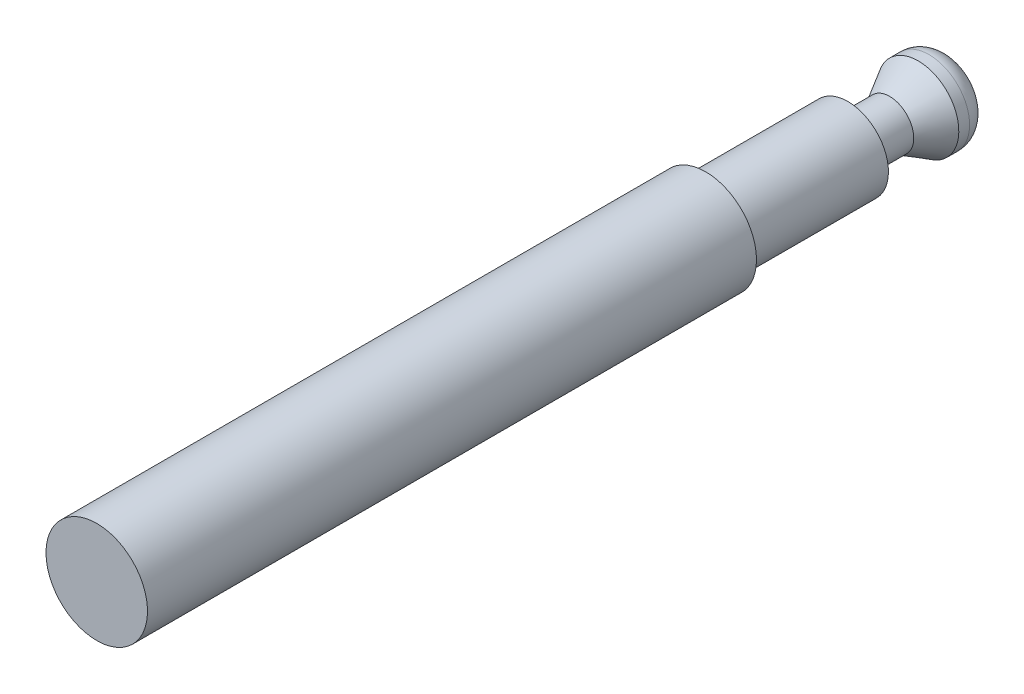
ISO-10303-21;
HEADER;
FILE_DESCRIPTION(('STEP AP214'),'2;1');
FILE_NAME('part.step','',(''),(''),'','','');
FILE_SCHEMA(('AUTOMOTIVE_DESIGN { 1 0 10303 214 1 1 1 1 }'));
ENDSEC;
DATA;
#1=APPLICATION_CONTEXT('core data for automotive mechanical design processes');
#2=APPLICATION_PROTOCOL_DEFINITION('international standard','automotive_design',2000,#1);
#3=PRODUCT_CONTEXT('',#1,'mechanical');
#4=PRODUCT('Part','Part','',(#3));
#5=PRODUCT_RELATED_PRODUCT_CATEGORY('part','',(#4));
#6=PRODUCT_DEFINITION_FORMATION('','',#4);
#7=PRODUCT_DEFINITION_CONTEXT('part definition',#1,'design');
#8=PRODUCT_DEFINITION('design','',#6,#7);
#9=PRODUCT_DEFINITION_SHAPE('','',#8);
#10=(LENGTH_UNIT() NAMED_UNIT(*) SI_UNIT(.MILLI.,.METRE.));
#11=(NAMED_UNIT(*) PLANE_ANGLE_UNIT() SI_UNIT($,.RADIAN.));
#12=(NAMED_UNIT(*) SI_UNIT($,.STERADIAN.) SOLID_ANGLE_UNIT());
#13=UNCERTAINTY_MEASURE_WITH_UNIT(LENGTH_MEASURE(1.E-05),#10,'distance_accuracy_value','');
#14=(GEOMETRIC_REPRESENTATION_CONTEXT(3) GLOBAL_UNCERTAINTY_ASSIGNED_CONTEXT((#13)) GLOBAL_UNIT_ASSIGNED_CONTEXT((#10,
#11,#12)) REPRESENTATION_CONTEXT('',''));
#15=CARTESIAN_POINT('',(0.,0.,0.));
#16=DIRECTION('',(0.,0.,1.));
#17=DIRECTION('',(1.,0.,0.));
#18=AXIS2_PLACEMENT_3D('',#15,#16,#17);
#19=CARTESIAN_POINT('',(0.,0.,-168.));
#20=DIRECTION('',(0.,0.,-1.));
#21=DIRECTION('',(0.,1.,0.));
#22=AXIS2_PLACEMENT_3D('',#19,#20,#21);
#23=PLANE('',#22);
#24=CARTESIAN_POINT('',(0.,0.,-168.));
#25=DIRECTION('',(0.,0.,-1.));
#26=DIRECTION('',(0.,1.,0.));
#27=AXIS2_PLACEMENT_3D('',#24,#25,#26);
#28=CIRCLE('',#27,4.);
#29=CARTESIAN_POINT('',(0.,4.,-168.));
#30=VERTEX_POINT('',#29);
#31=EDGE_CURVE('E18',#30,#30,#28,.T.);
#32=ORIENTED_EDGE('',*,*,#31,.T.);
#33=EDGE_LOOP('',(#32));
#34=FACE_BOUND('',#33,.T.);
#35=ADVANCED_FACE('F12',(#34),#23,.T.);
#36=CARTESIAN_POINT('',(0.,0.,-120.));
#37=DIRECTION('',(0.,0.,-1.));
#38=DIRECTION('',(0.,1.,0.));
#39=AXIS2_PLACEMENT_3D('',#36,#37,#38);
#40=CYLINDRICAL_SURFACE('',#39,8.);
#41=CARTESIAN_POINT('',(0.,0.,-164.));
#42=DIRECTION('',(0.,0.,-1.));
#43=DIRECTION('',(0.,1.,0.));
#44=AXIS2_PLACEMENT_3D('',#41,#42,#43);
#45=CIRCLE('',#44,8.);
#46=CARTESIAN_POINT('',(0.,8.,-164.));
#47=VERTEX_POINT('',#46);
#48=EDGE_CURVE('E8',#47,#47,#45,.F.);
#49=ORIENTED_EDGE('',*,*,#48,.T.);
#50=EDGE_LOOP('',(#49));
#51=FACE_BOUND('',#50,.T.);
#52=CARTESIAN_POINT('',(0.,0.,-161.869165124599));
#53=DIRECTION('',(0.,0.,-1.));
#54=DIRECTION('',(0.,1.,0.));
#55=AXIS2_PLACEMENT_3D('',#52,#53,#54);
#56=CIRCLE('',#55,8.);
#57=CARTESIAN_POINT('',(0.,8.,-161.869165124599));
#58=VERTEX_POINT('',#57);
#59=EDGE_CURVE('E31',#58,#58,#56,.T.);
#60=ORIENTED_EDGE('',*,*,#59,.T.);
#61=EDGE_LOOP('',(#60));
#62=FACE_BOUND('',#61,.T.);
#63=ADVANCED_FACE('F65',(#51,#62),#40,.T.);
#64=CARTESIAN_POINT('',(0.,0.,-161.869165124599));
#65=DIRECTION('',(0.,0.,-1.));
#66=DIRECTION('',(0.,1.,0.));
#67=AXIS2_PLACEMENT_3D('',#64,#65,#66);
#68=CONICAL_SURFACE('',#67,8.,0.523598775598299);
#69=CARTESIAN_POINT('',(0.,0.,-156.24));
#70=DIRECTION('',(0.,0.,-1.));
#71=DIRECTION('',(0.,1.,0.));
#72=AXIS2_PLACEMENT_3D('',#69,#70,#71);
#73=CIRCLE('',#72,4.75);
#74=CARTESIAN_POINT('',(0.,4.75,-156.24));
#75=VERTEX_POINT('',#74);
#76=EDGE_CURVE('E34',#75,#75,#73,.T.);
#77=ORIENTED_EDGE('',*,*,#76,.T.);
#78=EDGE_LOOP('',(#77));
#79=FACE_BOUND('',#78,.T.);
#80=ORIENTED_EDGE('',*,*,#59,.F.);
#81=EDGE_LOOP('',(#80));
#82=FACE_BOUND('',#81,.T.);
#83=ADVANCED_FACE('F70',(#79,#82),#68,.T.);
#84=CARTESIAN_POINT('',(0.,0.,-120.));
#85=DIRECTION('',(0.,0.,-1.));
#86=DIRECTION('',(0.,1.,0.));
#87=AXIS2_PLACEMENT_3D('',#84,#85,#86);
#88=CYLINDRICAL_SURFACE('',#87,4.75);
#89=CARTESIAN_POINT('',(0.,0.,-149.));
#90=DIRECTION('',(0.,0.,-1.));
#91=DIRECTION('',(0.,1.,0.));
#92=AXIS2_PLACEMENT_3D('',#89,#90,#91);
#93=CIRCLE('',#92,4.75);
#94=CARTESIAN_POINT('',(0.,4.75,-149.));
#95=VERTEX_POINT('',#94);
#96=EDGE_CURVE('E26',#95,#95,#93,.T.);
#97=ORIENTED_EDGE('',*,*,#96,.T.);
#98=EDGE_LOOP('',(#97));
#99=FACE_BOUND('',#98,.T.);
#100=ORIENTED_EDGE('',*,*,#76,.F.);
#101=EDGE_LOOP('',(#100));
#102=FACE_BOUND('',#101,.T.);
#103=ADVANCED_FACE('F75',(#99,#102),#88,.T.);
#104=CARTESIAN_POINT('',(4.75,0.,-148.));
#105=DIRECTION('',(0.,0.,-1.));
#106=DIRECTION('',(0.,1.,0.));
#107=AXIS2_PLACEMENT_3D('',#104,#105,#106);
#108=PLANE('',#107);
#109=CARTESIAN_POINT('',(0.,0.,-148.));
#110=DIRECTION('',(0.,0.,-1.));
#111=DIRECTION('',(0.,1.,0.));
#112=AXIS2_PLACEMENT_3D('',#109,#110,#111);
#113=CIRCLE('',#112,5.75);
#114=CARTESIAN_POINT('',(0.,5.75,-148.));
#115=VERTEX_POINT('',#114);
#116=EDGE_CURVE('E22',#115,#115,#113,.F.);
#117=ORIENTED_EDGE('',*,*,#116,.T.);
#118=EDGE_LOOP('',(#117));
#119=FACE_BOUND('',#118,.T.);
#120=CARTESIAN_POINT('',(0.,0.,-148.));
#121=DIRECTION('',(0.,0.,-1.));
#122=DIRECTION('',(0.,1.,0.));
#123=AXIS2_PLACEMENT_3D('',#120,#121,#122);
#124=CIRCLE('',#123,8.);
#125=CARTESIAN_POINT('',(0.,8.,-148.));
#126=VERTEX_POINT('',#125);
#127=EDGE_CURVE('E37',#126,#126,#124,.T.);
#128=ORIENTED_EDGE('',*,*,#127,.T.);
#129=EDGE_LOOP('',(#128));
#130=FACE_BOUND('',#129,.T.);
#131=ADVANCED_FACE('F82',(#119,#130),#108,.T.);
#132=CARTESIAN_POINT('',(0.,0.,-120.));
#133=DIRECTION('',(0.,0.,-1.));
#134=DIRECTION('',(0.,1.,0.));
#135=AXIS2_PLACEMENT_3D('',#132,#133,#134);
#136=CYLINDRICAL_SURFACE('',#135,8.);
#137=CARTESIAN_POINT('',(0.,0.,-120.));
#138=DIRECTION('',(0.,0.,1.));
#139=DIRECTION('',(1.,0.,0.));
#140=AXIS2_PLACEMENT_3D('',#137,#138,#139);
#141=CIRCLE('',#140,8.);
#142=CARTESIAN_POINT('',(8.,0.,-120.));
#143=VERTEX_POINT('',#142);
#144=EDGE_CURVE('E40',#143,#143,#141,.F.);
#145=ORIENTED_EDGE('',*,*,#144,.T.);
#146=EDGE_LOOP('',(#145));
#147=FACE_BOUND('',#146,.T.);
#148=ORIENTED_EDGE('',*,*,#127,.F.);
#149=EDGE_LOOP('',(#148));
#150=FACE_BOUND('',#149,.T.);
#151=ADVANCED_FACE('F86',(#147,#150),#136,.T.);
#152=CARTESIAN_POINT('',(0.,0.,-149.));
#153=DIRECTION('',(0.,0.,-1.));
#154=DIRECTION('',(0.,1.,0.));
#155=AXIS2_PLACEMENT_3D('',#152,#153,#154);
#156=TOROIDAL_SURFACE('',#155,5.75,1.);
#157=ORIENTED_EDGE('',*,*,#116,.F.);
#158=EDGE_LOOP('',(#157));
#159=FACE_BOUND('',#158,.T.);
#160=ORIENTED_EDGE('',*,*,#96,.F.);
#161=EDGE_LOOP('',(#160));
#162=FACE_BOUND('',#161,.T.);
#163=ADVANCED_FACE('F90',(#159,#162),#156,.F.);
#164=CARTESIAN_POINT('',(0.,0.,-164.));
#165=DIRECTION('',(0.,0.,-1.));
#166=DIRECTION('',(0.,1.,0.));
#167=AXIS2_PLACEMENT_3D('',#164,#165,#166);
#168=DEGENERATE_TOROIDAL_SURFACE('',#167,4.,4.,.T.);
#169=ORIENTED_EDGE('',*,*,#48,.F.);
#170=EDGE_LOOP('',(#169));
#171=FACE_BOUND('',#170,.T.);
#172=ORIENTED_EDGE('',*,*,#31,.F.);
#173=EDGE_LOOP('',(#172));
#174=FACE_BOUND('',#173,.T.);
#175=ADVANCED_FACE('F94',(#171,#174),#168,.T.);
#176=CARTESIAN_POINT('',(0.,0.,0.));
#177=DIRECTION('',(0.,0.,-1.));
#178=DIRECTION('',(-1.,0.,0.));
#179=AXIS2_PLACEMENT_3D('',#176,#177,#178);
#180=CYLINDRICAL_SURFACE('',#179,10.);
#181=CARTESIAN_POINT('',(0.,0.,0.));
#182=DIRECTION('',(0.,0.,-1.));
#183=DIRECTION('',(-1.,0.,0.));
#184=AXIS2_PLACEMENT_3D('',#181,#182,#183);
#185=CIRCLE('',#184,10.);
#186=CARTESIAN_POINT('',(-10.,0.,0.));
#187=VERTEX_POINT('',#186);
#188=EDGE_CURVE('E46',#187,#187,#185,.T.);
#189=ORIENTED_EDGE('',*,*,#188,.T.);
#190=EDGE_LOOP('',(#189));
#191=FACE_BOUND('',#190,.T.);
#192=CARTESIAN_POINT('',(0.,0.,-120.));
#193=DIRECTION('',(0.,0.,1.));
#194=DIRECTION('',(1.,0.,0.));
#195=AXIS2_PLACEMENT_3D('',#192,#193,#194);
#196=CIRCLE('',#195,10.);
#197=CARTESIAN_POINT('',(10.,0.,-120.));
#198=VERTEX_POINT('',#197);
#199=EDGE_CURVE('E43',#198,#198,#196,.T.);
#200=ORIENTED_EDGE('',*,*,#199,.T.);
#201=EDGE_LOOP('',(#200));
#202=FACE_BOUND('',#201,.T.);
#203=ADVANCED_FACE('F50',(#191,#202),#180,.T.);
#204=CARTESIAN_POINT('',(0.,0.,-120.));
#205=DIRECTION('',(0.,0.,1.));
#206=DIRECTION('',(1.,0.,0.));
#207=AXIS2_PLACEMENT_3D('',#204,#205,#206);
#208=PLANE('',#207);
#209=ORIENTED_EDGE('',*,*,#144,.F.);
#210=EDGE_LOOP('',(#209));
#211=FACE_BOUND('',#210,.T.);
#212=ORIENTED_EDGE('',*,*,#199,.F.);
#213=EDGE_LOOP('',(#212));
#214=FACE_BOUND('',#213,.T.);
#215=ADVANCED_FACE('F55',(#211,#214),#208,.F.);
#216=CARTESIAN_POINT('',(0.,0.,0.));
#217=DIRECTION('',(0.,0.,-1.));
#218=DIRECTION('',(-1.,0.,0.));
#219=AXIS2_PLACEMENT_3D('',#216,#217,#218);
#220=PLANE('',#219);
#221=ORIENTED_EDGE('',*,*,#188,.F.);
#222=EDGE_LOOP('',(#221));
#223=FACE_BOUND('',#222,.T.);
#224=ADVANCED_FACE('F53',(#223),#220,.F.);
#225=CLOSED_SHELL('',(#35,#63,#83,#103,#131,#151,#163,#175,#203,#215,#224));
#226=MANIFOLD_SOLID_BREP('B1',#225);
#227=ADVANCED_BREP_SHAPE_REPRESENTATION('',(#18,#226),#14);
#228=SHAPE_DEFINITION_REPRESENTATION(#9,#227);
ENDSEC;
END-ISO-10303-21;
